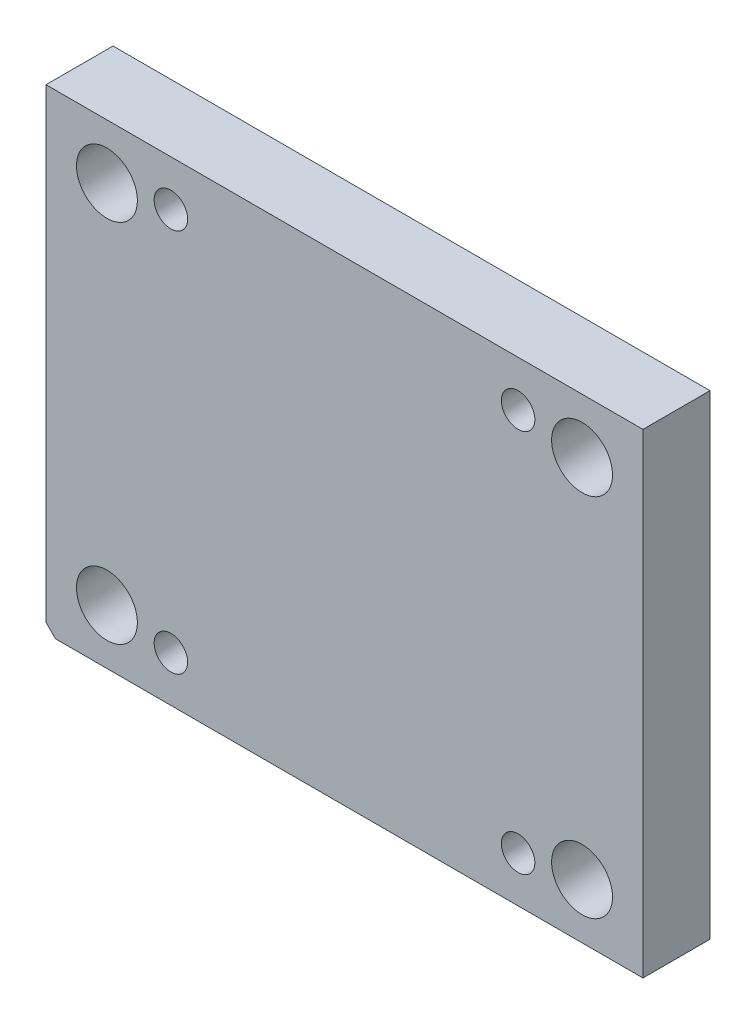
from build123d import *

# Parameters (mm, degrees)
SKETCH1_W            = 196
SKETCH1_H            = 156
BOSS_EXTRUDE1_DEPTH  = 22
DIAMETER_HOLE1_D     = 20
DIAMETER_HOLE1_DEPTH = 22
DIAMETER_HOLE1_TIP   = 6.00860619
HOLE1_D              = 11
HOLE1_CBORE_D        = 18
HOLE1_CBORE_DEPTH    = 13
CHAMFER1_SIZE        = 3.12
SKETCH6_R            = 45
CUT_EXTRUDE1_DEPTH   = 4.05


with BuildPart() as part:
    # Sketch1 → Boss-Extrude1 (new body)
    with BuildSketch(Plane.XY):
        Rectangle(SKETCH1_W, SKETCH1_H)
    extrude(amount=-BOSS_EXTRUDE1_DEPTH)

    # Diameter Hole1
    with Locations(Plane(origin=(-522.991452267, 0, 0), x_dir=(1, 0, 0), z_dir=(0, 0, 1))):
        with Locations((600.991452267, -60), (444.991452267, -60), (444.991452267, 60), (600.991452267, 60)):
            Hole(DIAMETER_HOLE1_D / 2, depth=DIAMETER_HOLE1_DEPTH)
            with Locations((0, 0, -(DIAMETER_HOLE1_DEPTH + DIAMETER_HOLE1_TIP / 2))):  # 118° drill point
                Cone(0, DIAMETER_HOLE1_D / 2, DIAMETER_HOLE1_TIP, mode=Mode.SUBTRACT)

    # Hole1 (through all)
    with Locations(Plane(origin=(0, 0, -22), x_dir=(1, 0, 0), z_dir=(0, 0, -1))):
        with Locations((57, 63), (-57, 63), (-57, -63), (57, -63)):
            CounterBoreHole(HOLE1_D / 2, HOLE1_CBORE_D / 2, HOLE1_CBORE_DEPTH)

    # Chamfer1
    chamfer1_edges = [part.edges().sort_by_distance(p)[0] for p in [
        (-98, -78, -11),
    ]]
    chamfer(chamfer1_edges, length=CHAMFER1_SIZE)

    # Sketch6 → Cut-Extrude1 (cut)
    with BuildSketch(Plane.XY.offset(-22)):
        Circle(SKETCH6_R)
    extrude(amount=CUT_EXTRUDE1_DEPTH, mode=Mode.SUBTRACT)


solid = part.part
